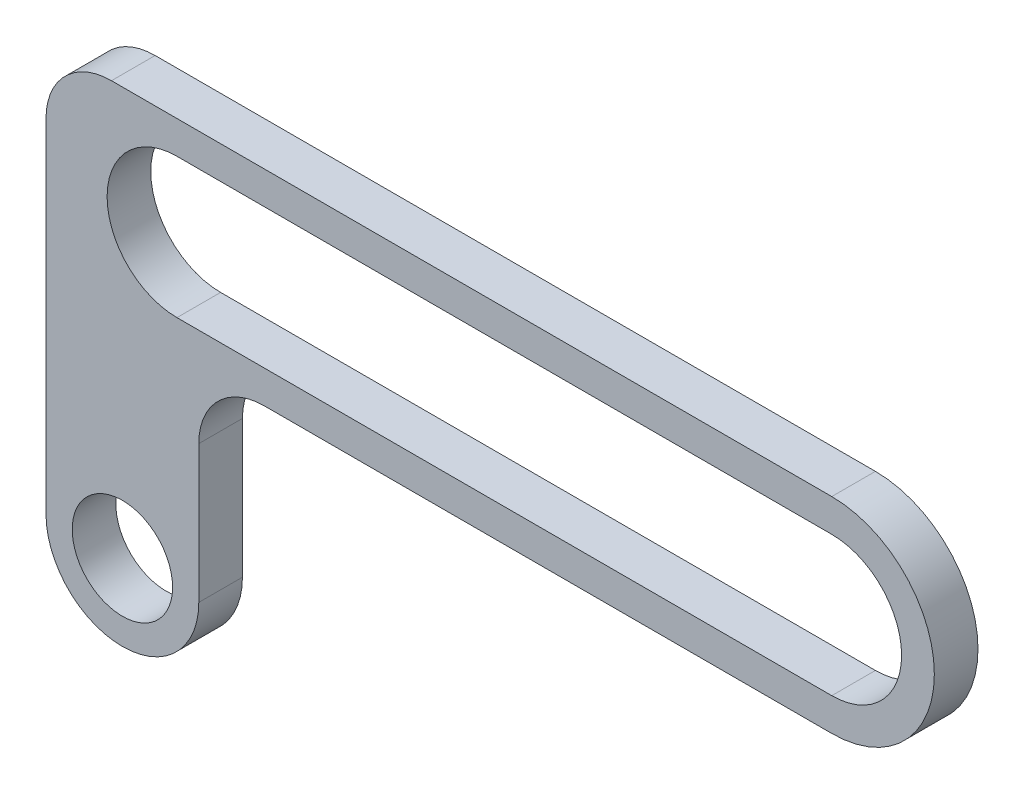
from build123d import *

# Parameters (mm, degrees)
ESQUISSE1_R        = 23
BOSS_EXTRU_1_DEPTH = 20
CONG_1_R           = 30


with BuildPart() as part:
    # Esquisse1 → Boss.-Extru.1 (new body)
    with BuildSketch(Plane.XY):
        with BuildLine():
            Line((-35, 0), (-35, 187))
            Line((-35, 187), (325, 187))
            ThreePointArc((325, 187), (372, 140), (325, 93))
            Line((325, 93), (35, 93))
            Line((35, 93), (35, 0))
            ThreePointArc((35, 0), (0, -35), (-35, 0))
        make_face()
        Circle(ESQUISSE1_R, mode=Mode.SUBTRACT)
        with BuildLine():
            Line((25, 172), (325, 172))
            ThreePointArc((325, 172), (357, 140), (325, 108))
            Line((325, 108), (25, 108))
            ThreePointArc((25, 108), (-7, 140), (25, 172))
        make_face(mode=Mode.SUBTRACT)
    extrude(amount=BOSS_EXTRU_1_DEPTH)

    # Cong_1
    cong_1_edges = [part.edges().sort_by_distance(p)[0] for p in [
        (-35, 187, 10),
        (35, 93, 10),
    ]]
    fillet(cong_1_edges, radius=CONG_1_R)


solid = part.part
